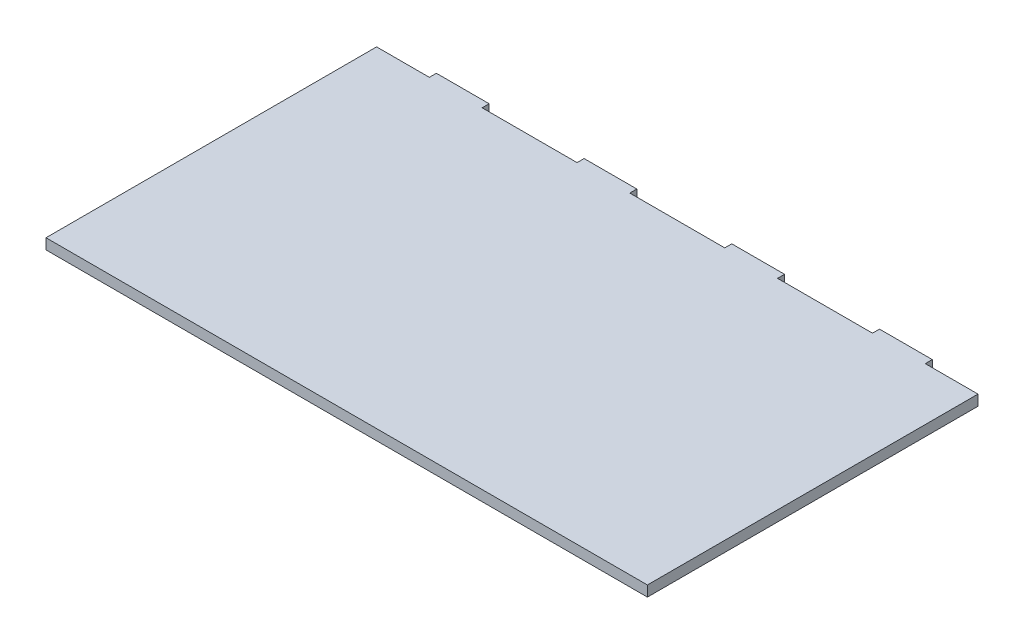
ISO-10303-21;
HEADER;
FILE_DESCRIPTION(('STEP AP214'),'2;1');
FILE_NAME('part.step','',(''),(''),'','','');
FILE_SCHEMA(('AUTOMOTIVE_DESIGN { 1 0 10303 214 1 1 1 1 }'));
ENDSEC;
DATA;
#1=APPLICATION_CONTEXT('core data for automotive mechanical design processes');
#2=APPLICATION_PROTOCOL_DEFINITION('international standard','automotive_design',2000,#1);
#3=PRODUCT_CONTEXT('',#1,'mechanical');
#4=PRODUCT('Part','Part','',(#3));
#5=PRODUCT_RELATED_PRODUCT_CATEGORY('part','',(#4));
#6=PRODUCT_DEFINITION_FORMATION('','',#4);
#7=PRODUCT_DEFINITION_CONTEXT('part definition',#1,'design');
#8=PRODUCT_DEFINITION('design','',#6,#7);
#9=PRODUCT_DEFINITION_SHAPE('','',#8);
#10=(LENGTH_UNIT() NAMED_UNIT(*) SI_UNIT(.MILLI.,.METRE.));
#11=(NAMED_UNIT(*) PLANE_ANGLE_UNIT() SI_UNIT($,.RADIAN.));
#12=(NAMED_UNIT(*) SI_UNIT($,.STERADIAN.) SOLID_ANGLE_UNIT());
#13=UNCERTAINTY_MEASURE_WITH_UNIT(LENGTH_MEASURE(1.E-05),#10,'distance_accuracy_value','');
#14=(GEOMETRIC_REPRESENTATION_CONTEXT(3) GLOBAL_UNCERTAINTY_ASSIGNED_CONTEXT((#13)) GLOBAL_UNIT_ASSIGNED_CONTEXT((#10,
#11,#12)) REPRESENTATION_CONTEXT('',''));
#15=CARTESIAN_POINT('',(0.,0.,0.));
#16=DIRECTION('',(0.,0.,1.));
#17=DIRECTION('',(1.,0.,0.));
#18=AXIS2_PLACEMENT_3D('',#15,#16,#17);
#19=CARTESIAN_POINT('',(342.,6.,0.));
#20=DIRECTION('',(1.,0.,0.));
#21=DIRECTION('',(0.,0.,-1.));
#22=AXIS2_PLACEMENT_3D('',#19,#20,#21);
#23=PLANE('',#22);
#24=DIRECTION('',(0.,0.,1.));
#25=VECTOR('',#24,1.);
#26=CARTESIAN_POINT('',(342.,0.,0.));
#27=LINE('',#26,#25);
#28=CARTESIAN_POINT('',(342.,0.,0.));
#29=VERTEX_POINT('',#28);
#30=CARTESIAN_POINT('',(342.,0.,188.));
#31=VERTEX_POINT('',#30);
#32=EDGE_CURVE('E246',#29,#31,#27,.T.);
#33=ORIENTED_EDGE('',*,*,#32,.F.);
#34=DIRECTION('',(0.,-1.,0.));
#35=VECTOR('',#34,1.);
#36=CARTESIAN_POINT('',(342.,6.,0.));
#37=LINE('',#36,#35);
#38=CARTESIAN_POINT('',(342.,6.,0.));
#39=VERTEX_POINT('',#38);
#40=EDGE_CURVE('E11',#39,#29,#37,.T.);
#41=ORIENTED_EDGE('',*,*,#40,.F.);
#42=DIRECTION('',(0.,0.,1.));
#43=VECTOR('',#42,1.);
#44=CARTESIAN_POINT('',(342.,6.,0.));
#45=LINE('',#44,#43);
#46=CARTESIAN_POINT('',(342.,6.,188.));
#47=VERTEX_POINT('',#46);
#48=EDGE_CURVE('E209',#39,#47,#45,.T.);
#49=ORIENTED_EDGE('',*,*,#48,.T.);
#50=DIRECTION('',(0.,-1.,0.));
#51=VECTOR('',#50,1.);
#52=CARTESIAN_POINT('',(342.,6.,188.));
#53=LINE('',#52,#51);
#54=EDGE_CURVE('E122',#47,#31,#53,.T.);
#55=ORIENTED_EDGE('',*,*,#54,.T.);
#56=EDGE_LOOP('',(#33,#41,#49,#55));
#57=FACE_BOUND('',#56,.T.);
#58=ADVANCED_FACE('F36',(#57),#23,.T.);
#59=CARTESIAN_POINT('',(0.,6.,0.));
#60=DIRECTION('',(0.,0.,-1.));
#61=DIRECTION('',(-1.,0.,0.));
#62=AXIS2_PLACEMENT_3D('',#59,#60,#61);
#63=PLANE('',#62);
#64=DIRECTION('',(1.,0.,0.));
#65=VECTOR('',#64,1.);
#66=CARTESIAN_POINT('',(0.,0.,0.));
#67=LINE('',#66,#65);
#68=CARTESIAN_POINT('',(312.,0.,0.));
#69=VERTEX_POINT('',#68);
#70=EDGE_CURVE('E249',#69,#29,#67,.T.);
#71=ORIENTED_EDGE('',*,*,#70,.F.);
#72=DIRECTION('',(0.,-1.,0.));
#73=VECTOR('',#72,1.);
#74=CARTESIAN_POINT('',(312.,6.,0.));
#75=LINE('',#74,#73);
#76=CARTESIAN_POINT('',(312.,6.,0.));
#77=VERTEX_POINT('',#76);
#78=EDGE_CURVE('E44',#77,#69,#75,.T.);
#79=ORIENTED_EDGE('',*,*,#78,.F.);
#80=DIRECTION('',(1.,0.,0.));
#81=VECTOR('',#80,1.);
#82=CARTESIAN_POINT('',(0.,6.,0.));
#83=LINE('',#82,#81);
#84=EDGE_CURVE('E198',#77,#39,#83,.T.);
#85=ORIENTED_EDGE('',*,*,#84,.T.);
#86=ORIENTED_EDGE('',*,*,#40,.T.);
#87=EDGE_LOOP('',(#71,#79,#85,#86));
#88=FACE_BOUND('',#87,.T.);
#89=ADVANCED_FACE('F332',(#88),#63,.T.);
#90=CARTESIAN_POINT('',(312.,6.,4.32986979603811E-12));
#91=DIRECTION('',(-1.,0.,0.));
#92=DIRECTION('',(0.,0.,1.));
#93=AXIS2_PLACEMENT_3D('',#90,#91,#92);
#94=PLANE('',#93);
#95=DIRECTION('',(0.,0.,-1.));
#96=VECTOR('',#95,1.);
#97=CARTESIAN_POINT('',(312.,0.,4.32986979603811E-12));
#98=LINE('',#97,#96);
#99=CARTESIAN_POINT('',(312.,0.,-4.));
#100=VERTEX_POINT('',#99);
#101=EDGE_CURVE('E252',#69,#100,#98,.T.);
#102=ORIENTED_EDGE('',*,*,#101,.T.);
#103=DIRECTION('',(0.,-1.,0.));
#104=VECTOR('',#103,1.);
#105=CARTESIAN_POINT('',(312.,6.,-4.));
#106=LINE('',#105,#104);
#107=CARTESIAN_POINT('',(312.,6.,-4.));
#108=VERTEX_POINT('',#107);
#109=EDGE_CURVE('E322',#108,#100,#106,.T.);
#110=ORIENTED_EDGE('',*,*,#109,.F.);
#111=DIRECTION('',(0.,0.,-1.));
#112=VECTOR('',#111,1.);
#113=CARTESIAN_POINT('',(312.,6.,4.32986979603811E-12));
#114=LINE('',#113,#112);
#115=EDGE_CURVE('E208',#77,#108,#114,.T.);
#116=ORIENTED_EDGE('',*,*,#115,.F.);
#117=ORIENTED_EDGE('',*,*,#78,.T.);
#118=EDGE_LOOP('',(#102,#110,#116,#117));
#119=FACE_BOUND('',#118,.T.);
#120=ADVANCED_FACE('F326',(#119),#94,.F.);
#121=CARTESIAN_POINT('',(0.,6.,-4.));
#122=DIRECTION('',(0.,0.,-1.));
#123=DIRECTION('',(-1.,0.,0.));
#124=AXIS2_PLACEMENT_3D('',#121,#122,#123);
#125=PLANE('',#124);
#126=DIRECTION('',(1.,0.,0.));
#127=VECTOR('',#126,1.);
#128=CARTESIAN_POINT('',(0.,0.,-4.));
#129=LINE('',#128,#127);
#130=CARTESIAN_POINT('',(282.,0.,-4.));
#131=VERTEX_POINT('',#130);
#132=EDGE_CURVE('E256',#131,#100,#129,.T.);
#133=ORIENTED_EDGE('',*,*,#132,.F.);
#134=DIRECTION('',(0.,-1.,0.));
#135=VECTOR('',#134,1.);
#136=CARTESIAN_POINT('',(282.,6.,-4.));
#137=LINE('',#136,#135);
#138=CARTESIAN_POINT('',(282.,6.,-4.));
#139=VERTEX_POINT('',#138);
#140=EDGE_CURVE('E320',#139,#131,#137,.T.);
#141=ORIENTED_EDGE('',*,*,#140,.F.);
#142=DIRECTION('',(1.,0.,0.));
#143=VECTOR('',#142,1.);
#144=CARTESIAN_POINT('',(0.,6.,-4.));
#145=LINE('',#144,#143);
#146=EDGE_CURVE('E213',#139,#108,#145,.T.);
#147=ORIENTED_EDGE('',*,*,#146,.T.);
#148=ORIENTED_EDGE('',*,*,#109,.T.);
#149=EDGE_LOOP('',(#133,#141,#147,#148));
#150=FACE_BOUND('',#149,.T.);
#151=ADVANCED_FACE('F340',(#150),#125,.T.);
#152=CARTESIAN_POINT('',(282.,6.,0.));
#153=DIRECTION('',(-1.,0.,0.));
#154=DIRECTION('',(0.,0.,1.));
#155=AXIS2_PLACEMENT_3D('',#152,#153,#154);
#156=PLANE('',#155);
#157=DIRECTION('',(0.,0.,-1.));
#158=VECTOR('',#157,1.);
#159=CARTESIAN_POINT('',(282.,0.,0.));
#160=LINE('',#159,#158);
#161=CARTESIAN_POINT('',(282.,0.,0.));
#162=VERTEX_POINT('',#161);
#163=EDGE_CURVE('E259',#162,#131,#160,.T.);
#164=ORIENTED_EDGE('',*,*,#163,.F.);
#165=DIRECTION('',(0.,-1.,0.));
#166=VECTOR('',#165,1.);
#167=CARTESIAN_POINT('',(282.,6.,0.));
#168=LINE('',#167,#166);
#169=CARTESIAN_POINT('',(282.,6.,0.));
#170=VERTEX_POINT('',#169);
#171=EDGE_CURVE('E318',#170,#162,#168,.T.);
#172=ORIENTED_EDGE('',*,*,#171,.F.);
#173=DIRECTION('',(0.,0.,-1.));
#174=VECTOR('',#173,1.);
#175=CARTESIAN_POINT('',(282.,6.,0.));
#176=LINE('',#175,#174);
#177=EDGE_CURVE('E217',#170,#139,#176,.T.);
#178=ORIENTED_EDGE('',*,*,#177,.T.);
#179=ORIENTED_EDGE('',*,*,#140,.T.);
#180=EDGE_LOOP('',(#164,#172,#178,#179));
#181=FACE_BOUND('',#180,.T.);
#182=ADVANCED_FACE('F344',(#181),#156,.T.);
#183=CARTESIAN_POINT('',(228.,0.,0.));
#184=VERTEX_POINT('',#183);
#185=EDGE_CURVE('E253',#184,#162,#67,.T.);
#186=ORIENTED_EDGE('',*,*,#185,.F.);
#187=DIRECTION('',(0.,-1.,0.));
#188=VECTOR('',#187,1.);
#189=CARTESIAN_POINT('',(228.,6.,0.));
#190=LINE('',#189,#188);
#191=CARTESIAN_POINT('',(228.,6.,0.));
#192=VERTEX_POINT('',#191);
#193=EDGE_CURVE('E316',#192,#184,#190,.T.);
#194=ORIENTED_EDGE('',*,*,#193,.F.);
#195=EDGE_CURVE('E210',#192,#170,#83,.T.);
#196=ORIENTED_EDGE('',*,*,#195,.T.);
#197=ORIENTED_EDGE('',*,*,#171,.T.);
#198=EDGE_LOOP('',(#186,#194,#196,#197));
#199=FACE_BOUND('',#198,.T.);
#200=ADVANCED_FACE('F391',(#199),#63,.T.);
#201=CARTESIAN_POINT('',(228.,6.,0.));
#202=DIRECTION('',(-1.,0.,0.));
#203=DIRECTION('',(0.,0.,1.));
#204=AXIS2_PLACEMENT_3D('',#201,#202,#203);
#205=PLANE('',#204);
#206=DIRECTION('',(0.,0.,-1.));
#207=VECTOR('',#206,1.);
#208=CARTESIAN_POINT('',(228.,0.,0.));
#209=LINE('',#208,#207);
#210=CARTESIAN_POINT('',(228.,0.,-4.));
#211=VERTEX_POINT('',#210);
#212=EDGE_CURVE('E262',#184,#211,#209,.T.);
#213=ORIENTED_EDGE('',*,*,#212,.T.);
#214=DIRECTION('',(0.,-1.,0.));
#215=VECTOR('',#214,1.);
#216=CARTESIAN_POINT('',(228.,6.,-4.));
#217=LINE('',#216,#215);
#218=CARTESIAN_POINT('',(228.,6.,-4.));
#219=VERTEX_POINT('',#218);
#220=EDGE_CURVE('E314',#219,#211,#217,.T.);
#221=ORIENTED_EDGE('',*,*,#220,.F.);
#222=DIRECTION('',(0.,0.,-1.));
#223=VECTOR('',#222,1.);
#224=CARTESIAN_POINT('',(228.,6.,0.));
#225=LINE('',#224,#223);
#226=EDGE_CURVE('E216',#192,#219,#225,.T.);
#227=ORIENTED_EDGE('',*,*,#226,.F.);
#228=ORIENTED_EDGE('',*,*,#193,.T.);
#229=EDGE_LOOP('',(#213,#221,#227,#228));
#230=FACE_BOUND('',#229,.T.);
#231=ADVANCED_FACE('F350',(#230),#205,.F.);
#232=CARTESIAN_POINT('',(0.,6.,-4.));
#233=DIRECTION('',(0.,0.,-1.));
#234=DIRECTION('',(-1.,0.,0.));
#235=AXIS2_PLACEMENT_3D('',#232,#233,#234);
#236=PLANE('',#235);
#237=DIRECTION('',(1.,0.,0.));
#238=VECTOR('',#237,1.);
#239=CARTESIAN_POINT('',(0.,0.,-4.));
#240=LINE('',#239,#238);
#241=CARTESIAN_POINT('',(198.,0.,-4.));
#242=VERTEX_POINT('',#241);
#243=EDGE_CURVE('E265',#242,#211,#240,.T.);
#244=ORIENTED_EDGE('',*,*,#243,.F.);
#245=DIRECTION('',(0.,-1.,0.));
#246=VECTOR('',#245,1.);
#247=CARTESIAN_POINT('',(198.,6.,-4.));
#248=LINE('',#247,#246);
#249=CARTESIAN_POINT('',(198.,6.,-4.));
#250=VERTEX_POINT('',#249);
#251=EDGE_CURVE('E312',#250,#242,#248,.T.);
#252=ORIENTED_EDGE('',*,*,#251,.F.);
#253=DIRECTION('',(1.,0.,0.));
#254=VECTOR('',#253,1.);
#255=CARTESIAN_POINT('',(0.,6.,-4.));
#256=LINE('',#255,#254);
#257=EDGE_CURVE('E220',#250,#219,#256,.T.);
#258=ORIENTED_EDGE('',*,*,#257,.T.);
#259=ORIENTED_EDGE('',*,*,#220,.T.);
#260=EDGE_LOOP('',(#244,#252,#258,#259));
#261=FACE_BOUND('',#260,.T.);
#262=ADVANCED_FACE('F354',(#261),#236,.T.);
#263=CARTESIAN_POINT('',(198.,6.,0.));
#264=DIRECTION('',(-1.,0.,0.));
#265=DIRECTION('',(0.,0.,1.));
#266=AXIS2_PLACEMENT_3D('',#263,#264,#265);
#267=PLANE('',#266);
#268=DIRECTION('',(0.,0.,-1.));
#269=VECTOR('',#268,1.);
#270=CARTESIAN_POINT('',(198.,0.,0.));
#271=LINE('',#270,#269);
#272=CARTESIAN_POINT('',(198.,0.,0.));
#273=VERTEX_POINT('',#272);
#274=EDGE_CURVE('E268',#273,#242,#271,.T.);
#275=ORIENTED_EDGE('',*,*,#274,.F.);
#276=DIRECTION('',(0.,-1.,0.));
#277=VECTOR('',#276,1.);
#278=CARTESIAN_POINT('',(198.,6.,0.));
#279=LINE('',#278,#277);
#280=CARTESIAN_POINT('',(198.,6.,0.));
#281=VERTEX_POINT('',#280);
#282=EDGE_CURVE('E310',#281,#273,#279,.T.);
#283=ORIENTED_EDGE('',*,*,#282,.F.);
#284=DIRECTION('',(0.,0.,-1.));
#285=VECTOR('',#284,1.);
#286=CARTESIAN_POINT('',(198.,6.,0.));
#287=LINE('',#286,#285);
#288=EDGE_CURVE('E226',#281,#250,#287,.T.);
#289=ORIENTED_EDGE('',*,*,#288,.T.);
#290=ORIENTED_EDGE('',*,*,#251,.T.);
#291=EDGE_LOOP('',(#275,#283,#289,#290));
#292=FACE_BOUND('',#291,.T.);
#293=ADVANCED_FACE('F356',(#292),#267,.T.);
#294=CARTESIAN_POINT('',(144.,0.,0.));
#295=VERTEX_POINT('',#294);
#296=EDGE_CURVE('E271',#295,#273,#67,.T.);
#297=ORIENTED_EDGE('',*,*,#296,.F.);
#298=DIRECTION('',(0.,-1.,0.));
#299=VECTOR('',#298,1.);
#300=CARTESIAN_POINT('',(144.,6.,0.));
#301=LINE('',#300,#299);
#302=CARTESIAN_POINT('',(144.,6.,0.));
#303=VERTEX_POINT('',#302);
#304=EDGE_CURVE('E308',#303,#295,#301,.T.);
#305=ORIENTED_EDGE('',*,*,#304,.F.);
#306=EDGE_CURVE('E206',#303,#281,#83,.T.);
#307=ORIENTED_EDGE('',*,*,#306,.T.);
#308=ORIENTED_EDGE('',*,*,#282,.T.);
#309=EDGE_LOOP('',(#297,#305,#307,#308));
#310=FACE_BOUND('',#309,.T.);
#311=ADVANCED_FACE('F388',(#310),#63,.T.);
#312=CARTESIAN_POINT('',(144.,6.,0.));
#313=DIRECTION('',(-1.,0.,0.));
#314=DIRECTION('',(0.,0.,1.));
#315=AXIS2_PLACEMENT_3D('',#312,#313,#314);
#316=PLANE('',#315);
#317=DIRECTION('',(0.,0.,-1.));
#318=VECTOR('',#317,1.);
#319=CARTESIAN_POINT('',(144.,0.,0.));
#320=LINE('',#319,#318);
#321=CARTESIAN_POINT('',(144.,0.,-4.));
#322=VERTEX_POINT('',#321);
#323=EDGE_CURVE('E272',#295,#322,#320,.T.);
#324=ORIENTED_EDGE('',*,*,#323,.T.);
#325=DIRECTION('',(0.,-1.,0.));
#326=VECTOR('',#325,1.);
#327=CARTESIAN_POINT('',(144.,6.,-4.));
#328=LINE('',#327,#326);
#329=CARTESIAN_POINT('',(144.,6.,-4.));
#330=VERTEX_POINT('',#329);
#331=EDGE_CURVE('E306',#330,#322,#328,.T.);
#332=ORIENTED_EDGE('',*,*,#331,.F.);
#333=DIRECTION('',(0.,0.,-1.));
#334=VECTOR('',#333,1.);
#335=CARTESIAN_POINT('',(144.,6.,0.));
#336=LINE('',#335,#334);
#337=EDGE_CURVE('E225',#303,#330,#336,.T.);
#338=ORIENTED_EDGE('',*,*,#337,.F.);
#339=ORIENTED_EDGE('',*,*,#304,.T.);
#340=EDGE_LOOP('',(#324,#332,#338,#339));
#341=FACE_BOUND('',#340,.T.);
#342=ADVANCED_FACE('F387',(#341),#316,.F.);
#343=CARTESIAN_POINT('',(0.,6.,-4.));
#344=DIRECTION('',(0.,0.,-1.));
#345=DIRECTION('',(-1.,0.,0.));
#346=AXIS2_PLACEMENT_3D('',#343,#344,#345);
#347=PLANE('',#346);
#348=DIRECTION('',(1.,0.,0.));
#349=VECTOR('',#348,1.);
#350=CARTESIAN_POINT('',(0.,0.,-4.));
#351=LINE('',#350,#349);
#352=CARTESIAN_POINT('',(114.,0.,-4.));
#353=VERTEX_POINT('',#352);
#354=EDGE_CURVE('E275',#353,#322,#351,.T.);
#355=ORIENTED_EDGE('',*,*,#354,.F.);
#356=DIRECTION('',(0.,-1.,0.));
#357=VECTOR('',#356,1.);
#358=CARTESIAN_POINT('',(114.,6.,-4.));
#359=LINE('',#358,#357);
#360=CARTESIAN_POINT('',(114.,6.,-4.));
#361=VERTEX_POINT('',#360);
#362=EDGE_CURVE('E304',#361,#353,#359,.T.);
#363=ORIENTED_EDGE('',*,*,#362,.F.);
#364=DIRECTION('',(1.,0.,0.));
#365=VECTOR('',#364,1.);
#366=CARTESIAN_POINT('',(0.,6.,-4.));
#367=LINE('',#366,#365);
#368=EDGE_CURVE('E229',#361,#330,#367,.T.);
#369=ORIENTED_EDGE('',*,*,#368,.T.);
#370=ORIENTED_EDGE('',*,*,#331,.T.);
#371=EDGE_LOOP('',(#355,#363,#369,#370));
#372=FACE_BOUND('',#371,.T.);
#373=ADVANCED_FACE('F382',(#372),#347,.T.);
#374=CARTESIAN_POINT('',(114.,6.,0.));
#375=DIRECTION('',(-1.,0.,0.));
#376=DIRECTION('',(0.,0.,1.));
#377=AXIS2_PLACEMENT_3D('',#374,#375,#376);
#378=PLANE('',#377);
#379=DIRECTION('',(0.,0.,-1.));
#380=VECTOR('',#379,1.);
#381=CARTESIAN_POINT('',(114.,0.,0.));
#382=LINE('',#381,#380);
#383=CARTESIAN_POINT('',(114.,0.,0.));
#384=VERTEX_POINT('',#383);
#385=EDGE_CURVE('E278',#384,#353,#382,.T.);
#386=ORIENTED_EDGE('',*,*,#385,.F.);
#387=DIRECTION('',(0.,-1.,0.));
#388=VECTOR('',#387,1.);
#389=CARTESIAN_POINT('',(114.,6.,0.));
#390=LINE('',#389,#388);
#391=CARTESIAN_POINT('',(114.,6.,0.));
#392=VERTEX_POINT('',#391);
#393=EDGE_CURVE('E302',#392,#384,#390,.T.);
#394=ORIENTED_EDGE('',*,*,#393,.F.);
#395=DIRECTION('',(0.,0.,-1.));
#396=VECTOR('',#395,1.);
#397=CARTESIAN_POINT('',(114.,6.,0.));
#398=LINE('',#397,#396);
#399=EDGE_CURVE('E205',#392,#361,#398,.T.);
#400=ORIENTED_EDGE('',*,*,#399,.T.);
#401=ORIENTED_EDGE('',*,*,#362,.T.);
#402=EDGE_LOOP('',(#386,#394,#400,#401));
#403=FACE_BOUND('',#402,.T.);
#404=ADVANCED_FACE('F379',(#403),#378,.T.);
#405=CARTESIAN_POINT('',(60.,0.,0.));
#406=VERTEX_POINT('',#405);
#407=EDGE_CURVE('E281',#406,#384,#67,.T.);
#408=ORIENTED_EDGE('',*,*,#407,.F.);
#409=DIRECTION('',(0.,-1.,0.));
#410=VECTOR('',#409,1.);
#411=CARTESIAN_POINT('',(60.,6.,0.));
#412=LINE('',#411,#410);
#413=CARTESIAN_POINT('',(60.,6.,0.));
#414=VERTEX_POINT('',#413);
#415=EDGE_CURVE('E300',#414,#406,#412,.T.);
#416=ORIENTED_EDGE('',*,*,#415,.F.);
#417=EDGE_CURVE('E197',#414,#392,#83,.T.);
#418=ORIENTED_EDGE('',*,*,#417,.T.);
#419=ORIENTED_EDGE('',*,*,#393,.T.);
#420=EDGE_LOOP('',(#408,#416,#418,#419));
#421=FACE_BOUND('',#420,.T.);
#422=ADVANCED_FACE('F374',(#421),#63,.T.);
#423=CARTESIAN_POINT('',(60.,6.,0.));
#424=DIRECTION('',(-1.,0.,0.));
#425=DIRECTION('',(0.,0.,1.));
#426=AXIS2_PLACEMENT_3D('',#423,#424,#425);
#427=PLANE('',#426);
#428=DIRECTION('',(0.,0.,-1.));
#429=VECTOR('',#428,1.);
#430=CARTESIAN_POINT('',(60.,0.,0.));
#431=LINE('',#430,#429);
#432=CARTESIAN_POINT('',(60.,0.,-4.));
#433=VERTEX_POINT('',#432);
#434=EDGE_CURVE('E282',#406,#433,#431,.T.);
#435=ORIENTED_EDGE('',*,*,#434,.T.);
#436=DIRECTION('',(0.,-1.,0.));
#437=VECTOR('',#436,1.);
#438=CARTESIAN_POINT('',(60.,6.,-4.));
#439=LINE('',#438,#437);
#440=CARTESIAN_POINT('',(60.,6.,-4.));
#441=VERTEX_POINT('',#440);
#442=EDGE_CURVE('E298',#441,#433,#439,.T.);
#443=ORIENTED_EDGE('',*,*,#442,.F.);
#444=DIRECTION('',(0.,0.,-1.));
#445=VECTOR('',#444,1.);
#446=CARTESIAN_POINT('',(60.,6.,0.));
#447=LINE('',#446,#445);
#448=EDGE_CURVE('E204',#414,#441,#447,.T.);
#449=ORIENTED_EDGE('',*,*,#448,.F.);
#450=ORIENTED_EDGE('',*,*,#415,.T.);
#451=EDGE_LOOP('',(#435,#443,#449,#450));
#452=FACE_BOUND('',#451,.T.);
#453=ADVANCED_FACE('F372',(#452),#427,.F.);
#454=CARTESIAN_POINT('',(0.,6.,-4.));
#455=DIRECTION('',(0.,0.,-1.));
#456=DIRECTION('',(-1.,0.,0.));
#457=AXIS2_PLACEMENT_3D('',#454,#455,#456);
#458=PLANE('',#457);
#459=DIRECTION('',(1.,0.,0.));
#460=VECTOR('',#459,1.);
#461=CARTESIAN_POINT('',(0.,0.,-4.));
#462=LINE('',#461,#460);
#463=CARTESIAN_POINT('',(30.,0.,-4.));
#464=VERTEX_POINT('',#463);
#465=EDGE_CURVE('E285',#464,#433,#462,.T.);
#466=ORIENTED_EDGE('',*,*,#465,.F.);
#467=DIRECTION('',(0.,-1.,0.));
#468=VECTOR('',#467,1.);
#469=CARTESIAN_POINT('',(30.,6.,-4.));
#470=LINE('',#469,#468);
#471=CARTESIAN_POINT('',(30.,6.,-4.));
#472=VERTEX_POINT('',#471);
#473=EDGE_CURVE('E296',#472,#464,#470,.T.);
#474=ORIENTED_EDGE('',*,*,#473,.F.);
#475=DIRECTION('',(1.,0.,0.));
#476=VECTOR('',#475,1.);
#477=CARTESIAN_POINT('',(0.,6.,-4.));
#478=LINE('',#477,#476);
#479=EDGE_CURVE('E199',#472,#441,#478,.T.);
#480=ORIENTED_EDGE('',*,*,#479,.T.);
#481=ORIENTED_EDGE('',*,*,#442,.T.);
#482=EDGE_LOOP('',(#466,#474,#480,#481));
#483=FACE_BOUND('',#482,.T.);
#484=ADVANCED_FACE('F368',(#483),#458,.T.);
#485=CARTESIAN_POINT('',(30.,6.,0.));
#486=DIRECTION('',(-1.,0.,0.));
#487=DIRECTION('',(0.,0.,1.));
#488=AXIS2_PLACEMENT_3D('',#485,#486,#487);
#489=PLANE('',#488);
#490=DIRECTION('',(0.,0.,-1.));
#491=VECTOR('',#490,1.);
#492=CARTESIAN_POINT('',(30.,0.,0.));
#493=LINE('',#492,#491);
#494=CARTESIAN_POINT('',(30.,0.,0.));
#495=VERTEX_POINT('',#494);
#496=EDGE_CURVE('E288',#495,#464,#493,.T.);
#497=ORIENTED_EDGE('',*,*,#496,.F.);
#498=DIRECTION('',(0.,-1.,0.));
#499=VECTOR('',#498,1.);
#500=CARTESIAN_POINT('',(30.,6.,0.));
#501=LINE('',#500,#499);
#502=CARTESIAN_POINT('',(30.,6.,0.));
#503=VERTEX_POINT('',#502);
#504=EDGE_CURVE('E185',#503,#495,#501,.T.);
#505=ORIENTED_EDGE('',*,*,#504,.F.);
#506=DIRECTION('',(0.,0.,-1.));
#507=VECTOR('',#506,1.);
#508=CARTESIAN_POINT('',(30.,6.,0.));
#509=LINE('',#508,#507);
#510=EDGE_CURVE('E195',#503,#472,#509,.T.);
#511=ORIENTED_EDGE('',*,*,#510,.T.);
#512=ORIENTED_EDGE('',*,*,#473,.T.);
#513=EDGE_LOOP('',(#497,#505,#511,#512));
#514=FACE_BOUND('',#513,.T.);
#515=ADVANCED_FACE('F366',(#514),#489,.T.);
#516=CARTESIAN_POINT('',(0.,0.,0.));
#517=VERTEX_POINT('',#516);
#518=EDGE_CURVE('E184',#517,#495,#67,.T.);
#519=ORIENTED_EDGE('',*,*,#518,.F.);
#520=DIRECTION('',(0.,-1.,0.));
#521=VECTOR('',#520,1.);
#522=CARTESIAN_POINT('',(0.,6.,0.));
#523=LINE('',#522,#521);
#524=CARTESIAN_POINT('',(0.,6.,0.));
#525=VERTEX_POINT('',#524);
#526=EDGE_CURVE('E178',#525,#517,#523,.T.);
#527=ORIENTED_EDGE('',*,*,#526,.F.);
#528=EDGE_CURVE('E182',#525,#503,#83,.T.);
#529=ORIENTED_EDGE('',*,*,#528,.T.);
#530=ORIENTED_EDGE('',*,*,#504,.T.);
#531=EDGE_LOOP('',(#519,#527,#529,#530));
#532=FACE_BOUND('',#531,.T.);
#533=ADVANCED_FACE('F180',(#532),#63,.T.);
#534=CARTESIAN_POINT('',(0.,6.,0.));
#535=DIRECTION('',(1.,0.,0.));
#536=DIRECTION('',(0.,0.,-1.));
#537=AXIS2_PLACEMENT_3D('',#534,#535,#536);
#538=PLANE('',#537);
#539=DIRECTION('',(0.,0.,1.));
#540=VECTOR('',#539,1.);
#541=CARTESIAN_POINT('',(0.,0.,0.));
#542=LINE('',#541,#540);
#543=CARTESIAN_POINT('',(0.,0.,188.));
#544=VERTEX_POINT('',#543);
#545=EDGE_CURVE('E115',#517,#544,#542,.T.);
#546=ORIENTED_EDGE('',*,*,#545,.T.);
#547=DIRECTION('',(0.,-1.,0.));
#548=VECTOR('',#547,1.);
#549=CARTESIAN_POINT('',(0.,6.,188.));
#550=LINE('',#549,#548);
#551=CARTESIAN_POINT('',(0.,6.,188.));
#552=VERTEX_POINT('',#551);
#553=EDGE_CURVE('E186',#552,#544,#550,.T.);
#554=ORIENTED_EDGE('',*,*,#553,.F.);
#555=DIRECTION('',(0.,0.,1.));
#556=VECTOR('',#555,1.);
#557=CARTESIAN_POINT('',(0.,6.,0.));
#558=LINE('',#557,#556);
#559=EDGE_CURVE('E188',#525,#552,#558,.T.);
#560=ORIENTED_EDGE('',*,*,#559,.F.);
#561=ORIENTED_EDGE('',*,*,#526,.T.);
#562=EDGE_LOOP('',(#546,#554,#560,#561));
#563=FACE_BOUND('',#562,.T.);
#564=ADVANCED_FACE('F189',(#563),#538,.F.);
#565=CARTESIAN_POINT('',(0.,6.,188.));
#566=DIRECTION('',(0.,0.,-1.));
#567=DIRECTION('',(-1.,0.,0.));
#568=AXIS2_PLACEMENT_3D('',#565,#566,#567);
#569=PLANE('',#568);
#570=DIRECTION('',(1.,0.,0.));
#571=VECTOR('',#570,1.);
#572=CARTESIAN_POINT('',(0.,0.,188.));
#573=LINE('',#572,#571);
#574=EDGE_CURVE('E214',#544,#31,#573,.T.);
#575=ORIENTED_EDGE('',*,*,#574,.T.);
#576=ORIENTED_EDGE('',*,*,#54,.F.);
#577=DIRECTION('',(1.,0.,0.));
#578=VECTOR('',#577,1.);
#579=CARTESIAN_POINT('',(0.,6.,188.));
#580=LINE('',#579,#578);
#581=EDGE_CURVE('E52',#552,#47,#580,.T.);
#582=ORIENTED_EDGE('',*,*,#581,.F.);
#583=ORIENTED_EDGE('',*,*,#553,.T.);
#584=EDGE_LOOP('',(#575,#576,#582,#583));
#585=FACE_BOUND('',#584,.T.);
#586=ADVANCED_FACE('F335',(#585),#569,.F.);
#587=CARTESIAN_POINT('',(0.,6.,0.));
#588=DIRECTION('',(0.,1.,0.));
#589=DIRECTION('',(0.,0.,1.));
#590=AXIS2_PLACEMENT_3D('',#587,#588,#589);
#591=PLANE('',#590);
#592=ORIENTED_EDGE('',*,*,#48,.F.);
#593=ORIENTED_EDGE('',*,*,#84,.F.);
#594=ORIENTED_EDGE('',*,*,#115,.T.);
#595=ORIENTED_EDGE('',*,*,#146,.F.);
#596=ORIENTED_EDGE('',*,*,#177,.F.);
#597=ORIENTED_EDGE('',*,*,#195,.F.);
#598=ORIENTED_EDGE('',*,*,#226,.T.);
#599=ORIENTED_EDGE('',*,*,#257,.F.);
#600=ORIENTED_EDGE('',*,*,#288,.F.);
#601=ORIENTED_EDGE('',*,*,#306,.F.);
#602=ORIENTED_EDGE('',*,*,#337,.T.);
#603=ORIENTED_EDGE('',*,*,#368,.F.);
#604=ORIENTED_EDGE('',*,*,#399,.F.);
#605=ORIENTED_EDGE('',*,*,#417,.F.);
#606=ORIENTED_EDGE('',*,*,#448,.T.);
#607=ORIENTED_EDGE('',*,*,#479,.F.);
#608=ORIENTED_EDGE('',*,*,#510,.F.);
#609=ORIENTED_EDGE('',*,*,#528,.F.);
#610=ORIENTED_EDGE('',*,*,#559,.T.);
#611=ORIENTED_EDGE('',*,*,#581,.T.);
#612=EDGE_LOOP('',(#592,#593,#594,#595,#596,#597,#598,#599,#600,#601,#602,#603,#604,#605,#606,
#607,#608,#609,#610,#611));
#613=FACE_BOUND('',#612,.T.);
#614=ADVANCED_FACE('F192',(#613),#591,.T.);
#615=CARTESIAN_POINT('',(0.,0.,0.));
#616=DIRECTION('',(0.,1.,0.));
#617=DIRECTION('',(0.,0.,1.));
#618=AXIS2_PLACEMENT_3D('',#615,#616,#617);
#619=PLANE('',#618);
#620=ORIENTED_EDGE('',*,*,#32,.T.);
#621=ORIENTED_EDGE('',*,*,#574,.F.);
#622=ORIENTED_EDGE('',*,*,#545,.F.);
#623=ORIENTED_EDGE('',*,*,#518,.T.);
#624=ORIENTED_EDGE('',*,*,#496,.T.);
#625=ORIENTED_EDGE('',*,*,#465,.T.);
#626=ORIENTED_EDGE('',*,*,#434,.F.);
#627=ORIENTED_EDGE('',*,*,#407,.T.);
#628=ORIENTED_EDGE('',*,*,#385,.T.);
#629=ORIENTED_EDGE('',*,*,#354,.T.);
#630=ORIENTED_EDGE('',*,*,#323,.F.);
#631=ORIENTED_EDGE('',*,*,#296,.T.);
#632=ORIENTED_EDGE('',*,*,#274,.T.);
#633=ORIENTED_EDGE('',*,*,#243,.T.);
#634=ORIENTED_EDGE('',*,*,#212,.F.);
#635=ORIENTED_EDGE('',*,*,#185,.T.);
#636=ORIENTED_EDGE('',*,*,#163,.T.);
#637=ORIENTED_EDGE('',*,*,#132,.T.);
#638=ORIENTED_EDGE('',*,*,#101,.F.);
#639=ORIENTED_EDGE('',*,*,#70,.T.);
#640=EDGE_LOOP('',(#620,#621,#622,#623,#624,#625,#626,#627,#628,#629,#630,#631,#632,#633,#634,
#635,#636,#637,#638,#639));
#641=FACE_BOUND('',#640,.T.);
#642=ADVANCED_FACE('F330',(#641),#619,.F.);
#643=CLOSED_SHELL('',(#58,#89,#120,#151,#182,#200,#231,#262,#293,#311,#342,#373,#404,#422,#453,
#484,#515,#533,#564,#586,#614,#642));
#644=MANIFOLD_SOLID_BREP('B2',#643);
#645=ADVANCED_BREP_SHAPE_REPRESENTATION('',(#18,#644),#14);
#646=SHAPE_DEFINITION_REPRESENTATION(#9,#645);
ENDSEC;
END-ISO-10303-21;
